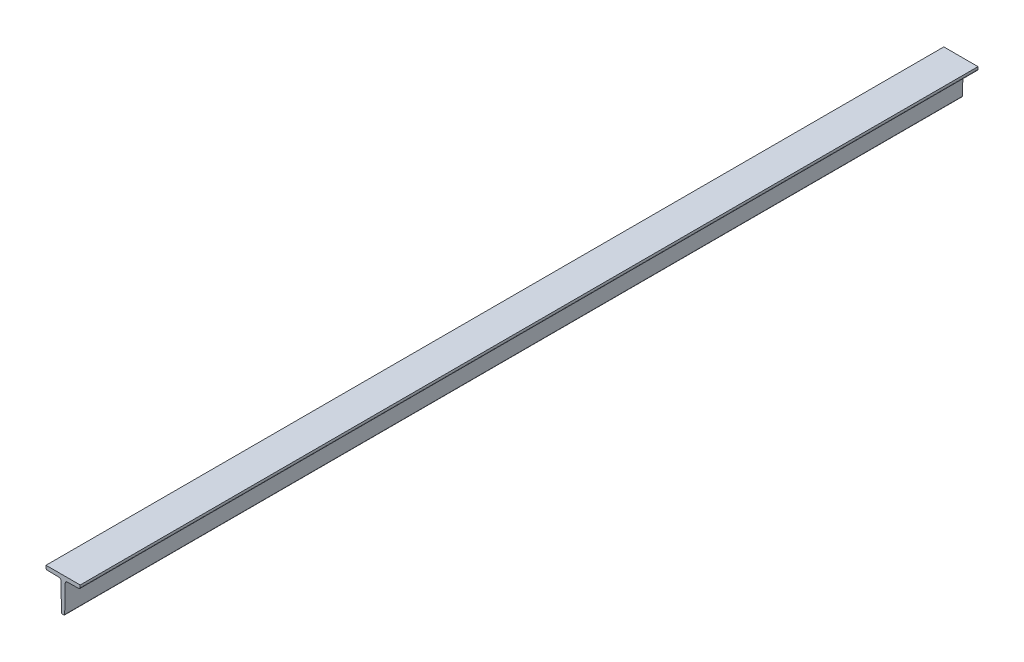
from build123d import *

# Parameters (mm, degrees)
LINEAR_AUSTRAGEN1_DEPTH = 1051


with BuildPart() as part:
    # Skizze1 → Linear austragen1 (new, symmetric)
    with BuildSketch(Plane.XY):
        with BuildLine():
            Line((-40, 0), (40, 0))
            Line((40, 0), (40, -5.48779513))
            ThreePointArc((40, -5.48779513), (39.092403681, -7.710294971), (36.888500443, -8.662160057))
            Line((36.888500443, -8.662160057), (9.436800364, -9.211307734))
            ThreePointArc((9.436800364, -9.211307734), (6.344820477, -10.528427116), (5.027701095, -13.620407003))
            Line((5.027701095, -13.620407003), (3.739042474, -78.040000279))
            ThreePointArc((3.739042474, -78.040000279), (3.13944242, -79.428285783), (1.73944252, -80))
            Line((1.73944252, -80), (-1.73944252, -80))
            ThreePointArc((-1.73944252, -80), (-3.13944242, -79.428285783), (-3.739042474, -78.040000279))
            Line((-3.739042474, -78.040000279), (-5.027701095, -13.620407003))
            ThreePointArc((-5.027701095, -13.620407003), (-6.344820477, -10.528427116), (-9.436800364, -9.211307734))
            Line((-9.436800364, -9.211307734), (-36.888500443, -8.662160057))
            ThreePointArc((-36.888500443, -8.662160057), (-39.092403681, -7.710294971), (-40, -5.48779513))
            Line((-40, -5.48779513), (-40, 0))
        make_face()
    extrude(amount=LINEAR_AUSTRAGEN1_DEPTH, both=True)


solid = part.part
